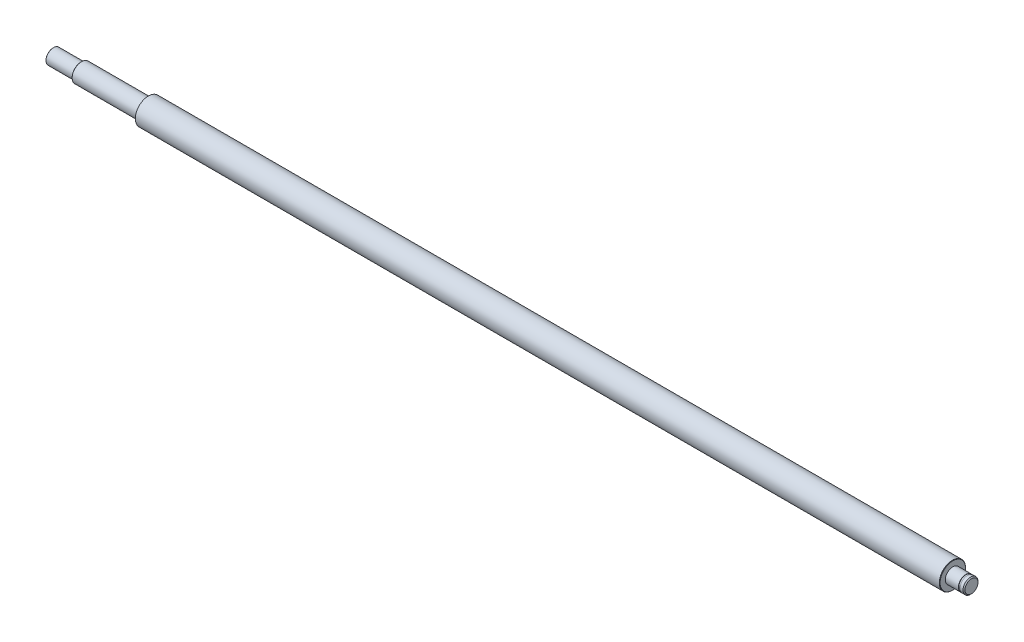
from build123d import *

# Parameters (mm, degrees)
CHANFREIN1_SIZE = 0.2


with BuildPart() as part:
    # Esquisse1 → R_volution1 (revolve)
    with BuildSketch(Plane.XY, mode=Mode.PRIVATE) as r_volution1_sk:
        Polygon((51, 7), (481.5, 7), (481.5, 4), (488.5, 4), (488.5, 3.8), (489.4, 3.8), (489.4, 4), (491, 4), (491.5, 3.5), (491.5, 0), (0, 0), (0, 4), (15, 4), (15, 5), (51, 5), align=None)
    revolve(r_volution1_sk.sketch.rotate(Axis((-39.851079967, 0, 0), (1, 0, 0)), 90), axis=Axis((-39.851079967, 0, 0), (1, 0, 0)))

    # Chanfrein1
    chanfrein1_edges = [part.edges().sort_by_distance(p)[0] for p in [
        (481.5, 0, -7),
        (15, 0, -5),
        (0, 0, -4),
    ]]
    chamfer(chanfrein1_edges, length=CHANFREIN1_SIZE)


solid = part.part
